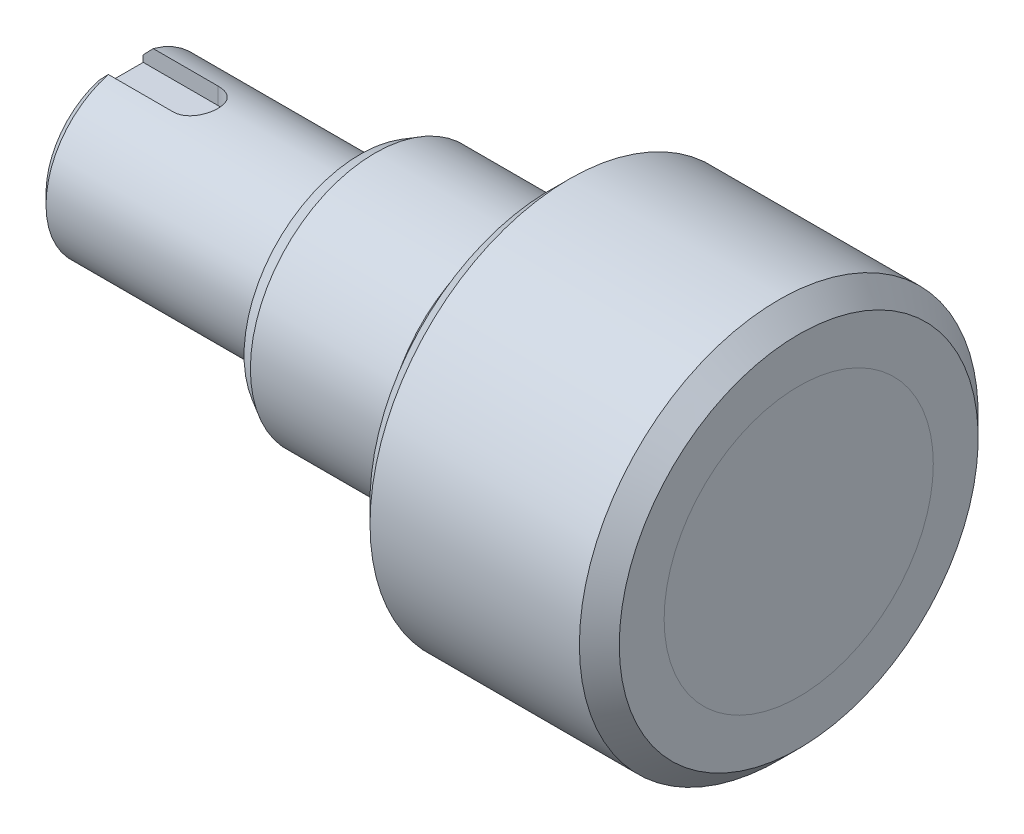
ISO-10303-21;
HEADER;
FILE_DESCRIPTION(('STEP AP214'),'2;1');
FILE_NAME('part.step','',(''),(''),'','','');
FILE_SCHEMA(('AUTOMOTIVE_DESIGN { 1 0 10303 214 1 1 1 1 }'));
ENDSEC;
DATA;
#1=APPLICATION_CONTEXT('core data for automotive mechanical design processes');
#2=APPLICATION_PROTOCOL_DEFINITION('international standard','automotive_design',2000,#1);
#3=PRODUCT_CONTEXT('',#1,'mechanical');
#4=PRODUCT('Part','Part','',(#3));
#5=PRODUCT_RELATED_PRODUCT_CATEGORY('part','',(#4));
#6=PRODUCT_DEFINITION_FORMATION('','',#4);
#7=PRODUCT_DEFINITION_CONTEXT('part definition',#1,'design');
#8=PRODUCT_DEFINITION('design','',#6,#7);
#9=PRODUCT_DEFINITION_SHAPE('','',#8);
#10=(LENGTH_UNIT() NAMED_UNIT(*) SI_UNIT(.MILLI.,.METRE.));
#11=(NAMED_UNIT(*) PLANE_ANGLE_UNIT() SI_UNIT($,.RADIAN.));
#12=(NAMED_UNIT(*) SI_UNIT($,.STERADIAN.) SOLID_ANGLE_UNIT());
#13=UNCERTAINTY_MEASURE_WITH_UNIT(LENGTH_MEASURE(1.E-05),#10,'distance_accuracy_value','');
#14=(GEOMETRIC_REPRESENTATION_CONTEXT(3) GLOBAL_UNCERTAINTY_ASSIGNED_CONTEXT((#13)) GLOBAL_UNIT_ASSIGNED_CONTEXT((#10,
#11,#12)) REPRESENTATION_CONTEXT('',''));
#15=CARTESIAN_POINT('',(0.,0.,0.));
#16=DIRECTION('',(0.,0.,1.));
#17=DIRECTION('',(1.,0.,0.));
#18=AXIS2_PLACEMENT_3D('',#15,#16,#17);
#19=CARTESIAN_POINT('',(0.,0.,0.));
#20=DIRECTION('',(1.,0.,0.));
#21=DIRECTION('',(0.,0.,-1.));
#22=AXIS2_PLACEMENT_3D('',#19,#20,#21);
#23=CYLINDRICAL_SURFACE('',#22,13.5);
#24=CARTESIAN_POINT('',(43.,0.,0.));
#25=DIRECTION('',(1.,0.,0.));
#26=DIRECTION('',(0.,0.,-1.));
#27=AXIS2_PLACEMENT_3D('',#24,#25,#26);
#28=CIRCLE('',#27,13.5);
#29=CARTESIAN_POINT('',(43.,0.,-13.5));
#30=VERTEX_POINT('',#29);
#31=EDGE_CURVE('E61',#30,#30,#28,.F.);
#32=ORIENTED_EDGE('',*,*,#31,.T.);
#33=EDGE_LOOP('',(#32));
#34=FACE_BOUND('',#33,.T.);
#35=CARTESIAN_POINT('',(68.,0.,0.));
#36=DIRECTION('',(-1.,0.,0.));
#37=DIRECTION('',(0.,0.,1.));
#38=AXIS2_PLACEMENT_3D('',#35,#36,#37);
#39=CIRCLE('',#38,13.5);
#40=CARTESIAN_POINT('',(68.,0.,13.5));
#41=VERTEX_POINT('',#40);
#42=EDGE_CURVE('E49',#41,#41,#39,.F.);
#43=ORIENTED_EDGE('',*,*,#42,.T.);
#44=EDGE_LOOP('',(#43));
#45=FACE_BOUND('',#44,.T.);
#46=ADVANCED_FACE('F45',(#34,#45),#23,.F.);
#47=CARTESIAN_POINT('',(0.,0.,0.));
#48=DIRECTION('',(-1.,0.,0.));
#49=DIRECTION('',(0.,0.,1.));
#50=AXIS2_PLACEMENT_3D('',#47,#48,#49);
#51=CYLINDRICAL_SURFACE('',#50,20.);
#52=CARTESIAN_POINT('',(45.,0.,0.));
#53=DIRECTION('',(1.,0.,0.));
#54=DIRECTION('',(0.,0.,-1.));
#55=AXIS2_PLACEMENT_3D('',#52,#53,#54);
#56=CIRCLE('',#55,20.);
#57=CARTESIAN_POINT('',(45.,0.,-20.));
#58=VERTEX_POINT('',#57);
#59=EDGE_CURVE('E58',#58,#58,#56,.T.);
#60=ORIENTED_EDGE('',*,*,#59,.T.);
#61=EDGE_LOOP('',(#60));
#62=FACE_BOUND('',#61,.T.);
#63=CARTESIAN_POINT('',(66.,0.,0.));
#64=DIRECTION('',(-1.,0.,0.));
#65=DIRECTION('',(0.,0.,1.));
#66=AXIS2_PLACEMENT_3D('',#63,#64,#65);
#67=CIRCLE('',#66,20.);
#68=CARTESIAN_POINT('',(66.,0.,20.));
#69=VERTEX_POINT('',#68);
#70=EDGE_CURVE('E53',#69,#69,#67,.T.);
#71=ORIENTED_EDGE('',*,*,#70,.T.);
#72=EDGE_LOOP('',(#71));
#73=FACE_BOUND('',#72,.T.);
#74=ADVANCED_FACE('F83',(#62,#73),#51,.T.);
#75=CARTESIAN_POINT('',(66.,0.,0.));
#76=DIRECTION('',(-1.,0.,0.));
#77=DIRECTION('',(0.,0.,1.));
#78=AXIS2_PLACEMENT_3D('',#75,#76,#77);
#79=CONICAL_SURFACE('',#78,20.,0.785398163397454);
#80=CARTESIAN_POINT('',(68.,0.,0.));
#81=DIRECTION('',(-1.,0.,0.));
#82=DIRECTION('',(0.,0.,1.));
#83=AXIS2_PLACEMENT_3D('',#80,#81,#82);
#84=CIRCLE('',#83,18.);
#85=CARTESIAN_POINT('',(68.,0.,18.));
#86=VERTEX_POINT('',#85);
#87=EDGE_CURVE('E63',#86,#86,#84,.F.);
#88=ORIENTED_EDGE('',*,*,#87,.F.);
#89=EDGE_LOOP('',(#88));
#90=FACE_BOUND('',#89,.T.);
#91=ORIENTED_EDGE('',*,*,#70,.F.);
#92=EDGE_LOOP('',(#91));
#93=FACE_BOUND('',#92,.T.);
#94=ADVANCED_FACE('F75',(#90,#93),#79,.T.);
#95=CARTESIAN_POINT('',(68.,20.,0.));
#96=DIRECTION('',(-1.,0.,0.));
#97=DIRECTION('',(0.,0.,1.));
#98=AXIS2_PLACEMENT_3D('',#95,#96,#97);
#99=PLANE('',#98);
#100=ORIENTED_EDGE('',*,*,#87,.T.);
#101=EDGE_LOOP('',(#100));
#102=FACE_BOUND('',#101,.T.);
#103=ORIENTED_EDGE('',*,*,#42,.F.);
#104=EDGE_LOOP('',(#103));
#105=FACE_BOUND('',#104,.T.);
#106=ADVANCED_FACE('F72',(#102,#105),#99,.F.);
#107=CARTESIAN_POINT('',(43.,0.,0.));
#108=DIRECTION('',(1.,0.,0.));
#109=DIRECTION('',(0.,0.,-1.));
#110=AXIS2_PLACEMENT_3D('',#107,#108,#109);
#111=CONICAL_SURFACE('',#110,18.,0.785398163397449);
#112=ORIENTED_EDGE('',*,*,#59,.F.);
#113=EDGE_LOOP('',(#112));
#114=FACE_BOUND('',#113,.T.);
#115=CARTESIAN_POINT('',(43.,0.,0.));
#116=DIRECTION('',(1.,0.,0.));
#117=DIRECTION('',(0.,0.,-1.));
#118=AXIS2_PLACEMENT_3D('',#115,#116,#117);
#119=CIRCLE('',#118,18.);
#120=CARTESIAN_POINT('',(43.,0.,-18.));
#121=VERTEX_POINT('',#120);
#122=EDGE_CURVE('E11',#121,#121,#119,.F.);
#123=ORIENTED_EDGE('',*,*,#122,.F.);
#124=EDGE_LOOP('',(#123));
#125=FACE_BOUND('',#124,.T.);
#126=ADVANCED_FACE('F74',(#114,#125),#111,.T.);
#127=CARTESIAN_POINT('',(43.,12.5,0.));
#128=DIRECTION('',(1.,0.,0.));
#129=DIRECTION('',(0.,0.,-1.));
#130=AXIS2_PLACEMENT_3D('',#127,#128,#129);
#131=PLANE('',#130);
#132=ORIENTED_EDGE('',*,*,#122,.T.);
#133=EDGE_LOOP('',(#132));
#134=FACE_BOUND('',#133,.T.);
#135=ORIENTED_EDGE('',*,*,#31,.F.);
#136=EDGE_LOOP('',(#135));
#137=FACE_BOUND('',#136,.T.);
#138=ADVANCED_FACE('F47',(#134,#137),#131,.F.);
#139=CLOSED_SHELL('',(#46,#74,#94,#106,#126,#138));
#140=MANIFOLD_SOLID_BREP('B2',#139);
#141=CARTESIAN_POINT('',(0.,0.,0.));
#142=DIRECTION('',(1.,0.,0.));
#143=DIRECTION('',(0.,0.,-1.));
#144=AXIS2_PLACEMENT_3D('',#141,#142,#143);
#145=CYLINDRICAL_SURFACE('',#144,13.5);
#146=CARTESIAN_POINT('',(68.,0.,0.));
#147=DIRECTION('',(-1.,0.,0.));
#148=DIRECTION('',(0.,0.,1.));
#149=AXIS2_PLACEMENT_3D('',#146,#147,#148);
#150=CIRCLE('',#149,13.5);
#151=CARTESIAN_POINT('',(68.,0.,13.5));
#152=VERTEX_POINT('',#151);
#153=EDGE_CURVE('E152',#152,#152,#150,.F.);
#154=ORIENTED_EDGE('',*,*,#153,.F.);
#155=EDGE_LOOP('',(#154));
#156=FACE_BOUND('',#155,.T.);
#157=CARTESIAN_POINT('',(43.,0.,0.));
#158=DIRECTION('',(1.,0.,0.));
#159=DIRECTION('',(0.,0.,-1.));
#160=AXIS2_PLACEMENT_3D('',#157,#158,#159);
#161=CIRCLE('',#160,13.5);
#162=CARTESIAN_POINT('',(43.,0.,-13.5));
#163=VERTEX_POINT('',#162);
#164=EDGE_CURVE('E43',#163,#163,#161,.F.);
#165=ORIENTED_EDGE('',*,*,#164,.F.);
#166=EDGE_LOOP('',(#165));
#167=FACE_BOUND('',#166,.T.);
#168=ADVANCED_FACE('F143',(#156,#167),#145,.T.);
#169=CARTESIAN_POINT('',(68.,20.,0.));
#170=DIRECTION('',(-1.,0.,0.));
#171=DIRECTION('',(0.,0.,1.));
#172=AXIS2_PLACEMENT_3D('',#169,#170,#171);
#173=PLANE('',#172);
#174=ORIENTED_EDGE('',*,*,#153,.T.);
#175=EDGE_LOOP('',(#174));
#176=FACE_BOUND('',#175,.T.);
#177=ADVANCED_FACE('F295',(#176),#173,.F.);
#178=CARTESIAN_POINT('',(0.,0.,0.));
#179=DIRECTION('',(-1.,0.,0.));
#180=DIRECTION('',(0.,0.,1.));
#181=AXIS2_PLACEMENT_3D('',#178,#179,#180);
#182=CYLINDRICAL_SURFACE('',#181,12.5);
#183=CARTESIAN_POINT('',(43.,0.,0.));
#184=DIRECTION('',(-1.,0.,0.));
#185=DIRECTION('',(0.,0.,1.));
#186=AXIS2_PLACEMENT_3D('',#183,#184,#185);
#187=CIRCLE('',#186,12.5);
#188=CARTESIAN_POINT('',(43.,0.,12.5));
#189=VERTEX_POINT('',#188);
#190=EDGE_CURVE('E232',#189,#189,#187,.T.);
#191=ORIENTED_EDGE('',*,*,#190,.T.);
#192=EDGE_LOOP('',(#191));
#193=FACE_BOUND('',#192,.T.);
#194=CARTESIAN_POINT('',(41.,0.,0.));
#195=DIRECTION('',(-1.,0.,0.));
#196=DIRECTION('',(0.,0.,1.));
#197=AXIS2_PLACEMENT_3D('',#194,#195,#196);
#198=CIRCLE('',#197,12.5);
#199=CARTESIAN_POINT('',(41.,0.,12.5));
#200=VERTEX_POINT('',#199);
#201=EDGE_CURVE('E223',#200,#200,#198,.T.);
#202=ORIENTED_EDGE('',*,*,#201,.F.);
#203=EDGE_LOOP('',(#202));
#204=FACE_BOUND('',#203,.T.);
#205=ADVANCED_FACE('F289',(#193,#204),#182,.T.);
#206=CARTESIAN_POINT('',(43.,12.5,0.));
#207=DIRECTION('',(1.,0.,0.));
#208=DIRECTION('',(0.,0.,-1.));
#209=AXIS2_PLACEMENT_3D('',#206,#207,#208);
#210=PLANE('',#209);
#211=ORIENTED_EDGE('',*,*,#164,.T.);
#212=EDGE_LOOP('',(#211));
#213=FACE_BOUND('',#212,.T.);
#214=ORIENTED_EDGE('',*,*,#190,.F.);
#215=EDGE_LOOP('',(#214));
#216=FACE_BOUND('',#215,.T.);
#217=ADVANCED_FACE('F290',(#213,#216),#210,.F.);
#218=CARTESIAN_POINT('',(39.,0.,0.));
#219=DIRECTION('',(-1.,0.,0.));
#220=DIRECTION('',(0.,0.,1.));
#221=AXIS2_PLACEMENT_3D('',#218,#219,#220);
#222=CONICAL_SURFACE('',#221,12.5,0.785398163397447);
#223=CARTESIAN_POINT('',(40.,0.,0.));
#224=DIRECTION('',(-1.,0.,0.));
#225=DIRECTION('',(0.,0.,1.));
#226=AXIS2_PLACEMENT_3D('',#223,#224,#225);
#227=CIRCLE('',#226,11.5);
#228=CARTESIAN_POINT('',(40.,0.,11.5));
#229=VERTEX_POINT('',#228);
#230=EDGE_CURVE('E226',#229,#229,#227,.T.);
#231=ORIENTED_EDGE('',*,*,#230,.T.);
#232=EDGE_LOOP('',(#231));
#233=FACE_BOUND('',#232,.T.);
#234=CARTESIAN_POINT('',(39.,0.,0.));
#235=DIRECTION('',(-1.,0.,0.));
#236=DIRECTION('',(0.,0.,1.));
#237=AXIS2_PLACEMENT_3D('',#234,#235,#236);
#238=CIRCLE('',#237,12.5);
#239=CARTESIAN_POINT('',(39.,0.,12.5));
#240=VERTEX_POINT('',#239);
#241=EDGE_CURVE('E229',#240,#240,#238,.T.);
#242=ORIENTED_EDGE('',*,*,#241,.F.);
#243=EDGE_LOOP('',(#242));
#244=FACE_BOUND('',#243,.T.);
#245=ADVANCED_FACE('F293',(#233,#244),#222,.T.);
#246=CARTESIAN_POINT('',(40.,0.,0.));
#247=DIRECTION('',(1.,0.,0.));
#248=DIRECTION('',(0.,0.,-1.));
#249=AXIS2_PLACEMENT_3D('',#246,#247,#248);
#250=CONICAL_SURFACE('',#249,11.5,0.785398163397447);
#251=ORIENTED_EDGE('',*,*,#201,.T.);
#252=EDGE_LOOP('',(#251));
#253=FACE_BOUND('',#252,.T.);
#254=ORIENTED_EDGE('',*,*,#230,.F.);
#255=EDGE_LOOP('',(#254));
#256=FACE_BOUND('',#255,.T.);
#257=ADVANCED_FACE('F300',(#253,#256),#250,.T.);
#258=CARTESIAN_POINT('',(0.,0.,0.));
#259=DIRECTION('',(1.,0.,0.));
#260=DIRECTION('',(0.,0.,-1.));
#261=AXIS2_PLACEMENT_3D('',#258,#259,#260);
#262=PLANE('',#261);
#263=DIRECTION('',(0.,0.,1.));
#264=VECTOR('',#263,1.);
#265=CARTESIAN_POINT('',(0.,6.5,2.25));
#266=LINE('',#265,#264);
#267=CARTESIAN_POINT('',(0.,6.5,-2.25));
#268=VERTEX_POINT('',#267);
#269=CARTESIAN_POINT('',(0.,6.5,2.25));
#270=VERTEX_POINT('',#269);
#271=EDGE_CURVE('E199',#268,#270,#266,.T.);
#272=ORIENTED_EDGE('',*,*,#271,.F.);
#273=DIRECTION('',(0.,1.,0.));
#274=VECTOR('',#273,1.);
#275=CARTESIAN_POINT('',(0.,6.5,-2.25));
#276=LINE('',#275,#274);
#277=CARTESIAN_POINT('',(0.,7.15454401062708,-2.25));
#278=VERTEX_POINT('',#277);
#279=EDGE_CURVE('E221',#268,#278,#276,.T.);
#280=ORIENTED_EDGE('',*,*,#279,.T.);
#281=CARTESIAN_POINT('',(0.,0.,0.));
#282=DIRECTION('',(1.,0.,0.));
#283=DIRECTION('',(0.,0.,-1.));
#284=AXIS2_PLACEMENT_3D('',#281,#282,#283);
#285=CIRCLE('',#284,7.49999999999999);
#286=CARTESIAN_POINT('',(0.,7.15454401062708,2.25));
#287=VERTEX_POINT('',#286);
#288=EDGE_CURVE('E211',#278,#287,#285,.F.);
#289=ORIENTED_EDGE('',*,*,#288,.T.);
#290=DIRECTION('',(0.,1.,0.));
#291=VECTOR('',#290,1.);
#292=CARTESIAN_POINT('',(0.,6.5,2.25));
#293=LINE('',#292,#291);
#294=EDGE_CURVE('E159',#270,#287,#293,.T.);
#295=ORIENTED_EDGE('',*,*,#294,.F.);
#296=EDGE_LOOP('',(#272,#280,#289,#295));
#297=FACE_BOUND('',#296,.T.);
#298=ADVANCED_FACE('F145',(#297),#262,.F.);
#299=CARTESIAN_POINT('',(0.,0.,0.));
#300=DIRECTION('',(-1.,0.,0.));
#301=DIRECTION('',(0.,0.,1.));
#302=AXIS2_PLACEMENT_3D('',#299,#300,#301);
#303=CYLINDRICAL_SURFACE('',#302,8.5);
#304=CARTESIAN_POINT('',(1.00000000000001,0.,0.));
#305=DIRECTION('',(1.,0.,0.));
#306=DIRECTION('',(0.,0.,-1.));
#307=AXIS2_PLACEMENT_3D('',#304,#305,#306);
#308=CIRCLE('',#307,8.5);
#309=CARTESIAN_POINT('',(1.00000000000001,8.1967981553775,2.25));
#310=VERTEX_POINT('',#309);
#311=CARTESIAN_POINT('',(1.00000000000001,8.1967981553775,-2.25));
#312=VERTEX_POINT('',#311);
#313=EDGE_CURVE('E239',#310,#312,#308,.T.);
#314=ORIENTED_EDGE('',*,*,#313,.T.);
#315=DIRECTION('',(-1.,0.,0.));
#316=VECTOR('',#315,1.);
#317=CARTESIAN_POINT('',(0.,8.1967981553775,-2.25));
#318=LINE('',#317,#316);
#319=CARTESIAN_POINT('',(7.5,8.1967981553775,-2.25));
#320=VERTEX_POINT('',#319);
#321=EDGE_CURVE('E167',#312,#320,#318,.F.);
#322=ORIENTED_EDGE('',*,*,#321,.T.);
#323=CARTESIAN_POINT('',(7.5,8.1967981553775,-2.25));
#324=CARTESIAN_POINT('',(7.56209437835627,8.19679073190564,-2.25000734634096));
#325=CARTESIAN_POINT('',(7.62418430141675,8.19750357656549,-2.24742964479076));
#326=CARTESIAN_POINT('',(7.74789725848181,8.20031471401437,-2.237161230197));
#327=CARTESIAN_POINT('',(7.80952037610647,8.20241275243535,-2.22947145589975));
#328=CARTESIAN_POINT('',(7.93173467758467,8.20793334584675,-2.20905768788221));
#329=CARTESIAN_POINT('',(7.99232777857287,8.21135307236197,-2.19634444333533));
#330=CARTESIAN_POINT('',(8.11217168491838,8.21940829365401,-2.16600365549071));
#331=CARTESIAN_POINT('',(8.17142246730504,8.22404380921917,-2.14837602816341));
#332=CARTESIAN_POINT('',(8.34652455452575,8.23957809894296,-2.08832126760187));
#333=CARTESIAN_POINT('',(8.45985726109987,8.25211100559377,-2.03870005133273));
#334=CARTESIAN_POINT('',(8.67657185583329,8.2801099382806,-1.92181388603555));
#335=CARTESIAN_POINT('',(8.77995051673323,8.29557691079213,-1.85454324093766));
#336=CARTESIAN_POINT('',(8.976405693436,8.32812589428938,-1.70249307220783));
#337=CARTESIAN_POINT('',(9.06920396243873,8.34523604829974,-1.61735938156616));
#338=CARTESIAN_POINT('',(9.23938699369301,8.37890142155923,-1.43275961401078));
#339=CARTESIAN_POINT('',(9.3167692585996,8.39545655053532,-1.33329121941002));
#340=CARTESIAN_POINT('',(9.45508971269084,8.4264612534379,-1.12090592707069));
#341=CARTESIAN_POINT('',(9.51574947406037,8.44087352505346,-1.00780175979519));
#342=CARTESIAN_POINT('',(9.61708356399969,8.46564323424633,-0.772560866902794));
#343=CARTESIAN_POINT('',(9.65776215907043,8.47600153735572,-0.650426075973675));
#344=CARTESIAN_POINT('',(9.71707749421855,8.49129706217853,-0.403512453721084));
#345=CARTESIAN_POINT('',(9.73619113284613,8.49635139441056,-0.278855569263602));
#346=CARTESIAN_POINT('',(9.75333399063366,8.5008788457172,-0.0280062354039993));
#347=CARTESIAN_POINT('',(9.75136622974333,8.50035276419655,0.0981859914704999));
#348=CARTESIAN_POINT('',(9.72673806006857,8.49386441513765,0.345200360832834));
#349=CARTESIAN_POINT('',(9.70459328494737,8.48803761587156,0.466078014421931));
#350=CARTESIAN_POINT('',(9.64107245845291,8.47176222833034,0.702335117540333));
#351=CARTESIAN_POINT('',(9.59969550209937,8.46131342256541,0.817714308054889));
#352=CARTESIAN_POINT('',(9.49848653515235,8.43676623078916,1.04102329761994));
#353=CARTESIAN_POINT('',(9.43847680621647,8.42263291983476,1.14886855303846));
#354=CARTESIAN_POINT('',(9.30184288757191,8.39224119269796,1.35313236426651));
#355=CARTESIAN_POINT('',(9.22521584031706,8.37598241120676,1.44954895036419));
#356=CARTESIAN_POINT('',(9.05479238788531,8.342523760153,1.6312885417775));
#357=CARTESIAN_POINT('',(8.96054784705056,8.32531029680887,1.71618924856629));
#358=CARTESIAN_POINT('',(8.75895378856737,8.29232157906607,1.86910165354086));
#359=CARTESIAN_POINT('',(8.65160066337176,8.27654672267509,1.93710868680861));
#360=CARTESIAN_POINT('',(8.42591350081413,8.24816400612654,2.05462473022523));
#361=CARTESIAN_POINT('',(8.30751237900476,8.23557748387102,2.10401013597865));
#362=CARTESIAN_POINT('',(8.06373999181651,8.21526847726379,2.18197482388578));
#363=CARTESIAN_POINT('',(7.93837949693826,8.20753869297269,2.21058534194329));
#364=CARTESIAN_POINT('',(7.75992335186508,8.2007540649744,2.23554738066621));
#365=CARTESIAN_POINT('',(7.70805593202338,8.19927314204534,2.24096766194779));
#366=CARTESIAN_POINT('',(7.60413404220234,8.19729547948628,2.24819010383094));
#367=CARTESIAN_POINT('',(7.55208000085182,8.19679717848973,2.24999800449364));
#368=CARTESIAN_POINT('',(7.5,8.1967981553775,2.25));
#369=B_SPLINE_CURVE_WITH_KNOTS('',3,(#323,#324,#325,#326,#327,#328,#329,#330,#331,#332,#333,
#334,#335,#336,#337,#338,#339,#340,#341,#342,#343,#344,#345,#346,#347,#348,#349,#350,#351,#352,
#353,#354,#355,#356,#357,#358,#359,#360,#361,#362,#363,#364,#365,#366,#367,#368),.UNSPECIFIED.,
.F.,.F.,(4,2,2,2,2,2,2,2,2,2,2,2,2,2,2,2,2,2,2,2,2,2,4),(0.,0.186217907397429,0.37240162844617,
0.558189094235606,0.743979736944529,1.11516504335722,1.48647029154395,1.86598333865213,
2.24555781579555,2.63111537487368,3.01659057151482,3.39336300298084,3.77008146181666,
4.13743473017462,4.50480528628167,4.8757934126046,5.24684538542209,5.62908857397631,
6.01143719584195,6.39628082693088,6.78054462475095,6.93694808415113,7.09310282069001),.UNSPECIFIED.);
#370=CARTESIAN_POINT('',(7.5,8.1967981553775,2.25));
#371=VERTEX_POINT('',#370);
#372=EDGE_CURVE('E268',#320,#371,#369,.T.);
#373=ORIENTED_EDGE('',*,*,#372,.T.);
#374=DIRECTION('',(-1.,0.,0.));
#375=VECTOR('',#374,1.);
#376=CARTESIAN_POINT('',(0.,8.1967981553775,2.25));
#377=LINE('',#376,#375);
#378=EDGE_CURVE('E218',#371,#310,#377,.T.);
#379=ORIENTED_EDGE('',*,*,#378,.T.);
#380=EDGE_LOOP('',(#314,#322,#373,#379));
#381=FACE_BOUND('',#380,.T.);
#382=CARTESIAN_POINT('',(24.,0.,0.));
#383=DIRECTION('',(-1.,0.,0.));
#384=DIRECTION('',(0.,0.,1.));
#385=AXIS2_PLACEMENT_3D('',#382,#383,#384);
#386=CIRCLE('',#385,8.5);
#387=CARTESIAN_POINT('',(24.,0.,8.5));
#388=VERTEX_POINT('',#387);
#389=EDGE_CURVE('E235',#388,#388,#386,.T.);
#390=ORIENTED_EDGE('',*,*,#389,.T.);
#391=EDGE_LOOP('',(#390));
#392=FACE_BOUND('',#391,.T.);
#393=ADVANCED_FACE('F276',(#381,#392),#303,.T.);
#394=CARTESIAN_POINT('',(24.,8.5,0.));
#395=DIRECTION('',(1.,0.,0.));
#396=DIRECTION('',(0.,0.,-1.));
#397=AXIS2_PLACEMENT_3D('',#394,#395,#396);
#398=PLANE('',#397);
#399=CARTESIAN_POINT('',(24.,0.,0.));
#400=DIRECTION('',(1.,0.,0.));
#401=DIRECTION('',(0.,0.,-1.));
#402=AXIS2_PLACEMENT_3D('',#399,#400,#401);
#403=CIRCLE('',#402,11.6339745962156);
#404=CARTESIAN_POINT('',(24.,0.,-11.6339745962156));
#405=VERTEX_POINT('',#404);
#406=EDGE_CURVE('E274',#405,#405,#403,.F.);
#407=ORIENTED_EDGE('',*,*,#406,.T.);
#408=EDGE_LOOP('',(#407));
#409=FACE_BOUND('',#408,.T.);
#410=ORIENTED_EDGE('',*,*,#389,.F.);
#411=EDGE_LOOP('',(#410));
#412=FACE_BOUND('',#411,.T.);
#413=ADVANCED_FACE('F280',(#409,#412),#398,.F.);
#414=CARTESIAN_POINT('',(25.5,0.,0.));
#415=DIRECTION('',(1.,0.,0.));
#416=DIRECTION('',(0.,0.,-1.));
#417=AXIS2_PLACEMENT_3D('',#414,#415,#416);
#418=CIRCLE('',#417,12.5);
#419=CARTESIAN_POINT('',(25.5,0.,-12.5));
#420=VERTEX_POINT('',#419);
#421=EDGE_CURVE('E325',#420,#420,#418,.T.);
#422=ORIENTED_EDGE('',*,*,#421,.T.);
#423=EDGE_LOOP('',(#422));
#424=FACE_BOUND('',#423,.T.);
#425=ORIENTED_EDGE('',*,*,#241,.T.);
#426=EDGE_LOOP('',(#425));
#427=FACE_BOUND('',#426,.T.);
#428=ADVANCED_FACE('F284',(#424,#427),#182,.T.);
#429=CARTESIAN_POINT('',(0.,0.,0.));
#430=DIRECTION('',(1.,0.,0.));
#431=DIRECTION('',(0.,0.,-1.));
#432=AXIS2_PLACEMENT_3D('',#429,#430,#431);
#433=CONICAL_SURFACE('',#432,7.49999999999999,0.785398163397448);
#434=CARTESIAN_POINT('',(3.25686433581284,10.5189177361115,-2.25));
#435=CARTESIAN_POINT('',(2.99811614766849,10.2543014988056,-2.25));
#436=CARTESIAN_POINT('',(2.73957180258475,9.98948532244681,-2.25));
#437=CARTESIAN_POINT('',(2.22303896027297,9.45931485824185,-2.25));
#438=CARTESIAN_POINT('',(1.96505045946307,9.19396057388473,-2.25));
#439=CARTESIAN_POINT('',(1.44980866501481,8.66260786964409,-2.25));
#440=CARTESIAN_POINT('',(1.1925552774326,8.39660954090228,-2.25));
#441=CARTESIAN_POINT('',(0.67896865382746,7.86372009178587,-2.25));
#442=CARTESIAN_POINT('',(0.422635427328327,7.59682896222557,-2.25));
#443=CARTESIAN_POINT('',(-0.0888249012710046,7.06181167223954,-2.25));
#444=CARTESIAN_POINT('',(-0.343951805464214,6.79368532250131,-2.25));
#445=CARTESIAN_POINT('',(-0.852463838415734,6.25579516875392,-2.25));
#446=CARTESIAN_POINT('',(-1.105849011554,5.98603140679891,-2.25));
#447=CARTESIAN_POINT('',(-1.48403453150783,5.57958593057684,-2.25));
#448=CARTESIAN_POINT('',(-1.60979053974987,5.44379368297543,-2.25));
#449=CARTESIAN_POINT('',(-1.8605078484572,5.17147924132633,-2.25));
#450=CARTESIAN_POINT('',(-1.98546915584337,5.03495705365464,-2.25));
#451=CARTESIAN_POINT('',(-2.23441710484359,4.76100396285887,-2.25));
#452=CARTESIAN_POINT('',(-2.35840366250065,4.62357298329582,-2.25));
#453=CARTESIAN_POINT('',(-2.60509930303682,4.34756254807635,-2.25));
#454=CARTESIAN_POINT('',(-2.72780834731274,4.20898305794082,-2.25));
#455=CARTESIAN_POINT('',(-2.84972886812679,4.06970780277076,-2.25));
#456=B_SPLINE_CURVE_WITH_KNOTS('',3,(#434,#435,#436,#437,#438,#439,#440,#441,#442,#443,#444,
#445,#446,#447,#448,#449,#450,#451,#452,#453,#454,#455),.UNSPECIFIED.,.F.,.F.,(4,2,2,2,2,2,2,2,
2,2,4),(0.,1.11029394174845,2.22058070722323,3.33071859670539,4.44086794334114,5.55119350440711,
6.66149066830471,7.21672415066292,7.77195279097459,8.3272287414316,8.88252142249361),.UNSPECIFIED.);
#457=EDGE_CURVE('E249',#312,#278,#456,.T.);
#458=ORIENTED_EDGE('',*,*,#457,.F.);
#459=ORIENTED_EDGE('',*,*,#313,.F.);
#460=CARTESIAN_POINT('',(-2.84972886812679,4.06970780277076,2.25));
#461=CARTESIAN_POINT('',(-2.72780834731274,4.20898305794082,2.25));
#462=CARTESIAN_POINT('',(-2.60509930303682,4.34756254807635,2.25));
#463=CARTESIAN_POINT('',(-2.35840366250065,4.62357298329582,2.25));
#464=CARTESIAN_POINT('',(-2.23441710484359,4.76100396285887,2.25));
#465=CARTESIAN_POINT('',(-1.98546915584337,5.03495705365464,2.25));
#466=CARTESIAN_POINT('',(-1.8605078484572,5.17147924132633,2.25));
#467=CARTESIAN_POINT('',(-1.60979053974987,5.44379368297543,2.25));
#468=CARTESIAN_POINT('',(-1.48403453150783,5.57958593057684,2.25));
#469=CARTESIAN_POINT('',(-1.105849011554,5.98603140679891,2.25));
#470=CARTESIAN_POINT('',(-0.852463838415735,6.25579516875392,2.25));
#471=CARTESIAN_POINT('',(-0.343951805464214,6.79368532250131,2.25));
#472=CARTESIAN_POINT('',(-0.0888249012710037,7.06181167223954,2.25));
#473=CARTESIAN_POINT('',(0.422635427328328,7.59682896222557,2.25));
#474=CARTESIAN_POINT('',(0.678968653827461,7.86372009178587,2.25));
#475=CARTESIAN_POINT('',(1.1925552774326,8.39660954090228,2.25));
#476=CARTESIAN_POINT('',(1.44980866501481,8.66260786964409,2.25));
#477=CARTESIAN_POINT('',(1.96505045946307,9.19396057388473,2.25));
#478=CARTESIAN_POINT('',(2.22303896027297,9.45931485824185,2.25));
#479=CARTESIAN_POINT('',(2.73957180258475,9.98948532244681,2.25));
#480=CARTESIAN_POINT('',(2.99811614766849,10.2543014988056,2.25));
#481=CARTESIAN_POINT('',(3.25686433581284,10.5189177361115,2.25));
#482=B_SPLINE_CURVE_WITH_KNOTS('',3,(#460,#461,#462,#463,#464,#465,#466,#467,#468,#469,#470,
#471,#472,#473,#474,#475,#476,#477,#478,#479,#480,#481),.UNSPECIFIED.,.F.,.F.,(4,2,2,2,2,2,2,2,
2,2,4),(0.,0.555292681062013,1.11056863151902,1.6657972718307,2.2210307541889,3.33132791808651,
4.44165347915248,5.55180282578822,6.66194071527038,7.77222748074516,8.88252142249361),.UNSPECIFIED.);
#483=EDGE_CURVE('E242',#287,#310,#482,.T.);
#484=ORIENTED_EDGE('',*,*,#483,.F.);
#485=ORIENTED_EDGE('',*,*,#288,.F.);
#486=EDGE_LOOP('',(#458,#459,#484,#485));
#487=FACE_BOUND('',#486,.T.);
#488=ADVANCED_FACE('F255',(#487),#433,.T.);
#489=CARTESIAN_POINT('',(7.5,6.5,0.));
#490=DIRECTION('',(0.,1.,0.));
#491=DIRECTION('',(0.,0.,1.));
#492=AXIS2_PLACEMENT_3D('',#489,#490,#491);
#493=CYLINDRICAL_SURFACE('',#492,2.25);
#494=DIRECTION('',(0.,1.,0.));
#495=VECTOR('',#494,1.);
#496=CARTESIAN_POINT('',(7.5,6.5,-2.25));
#497=LINE('',#496,#495);
#498=CARTESIAN_POINT('',(7.5,6.5,-2.25));
#499=VERTEX_POINT('',#498);
#500=EDGE_CURVE('E213',#499,#320,#497,.T.);
#501=ORIENTED_EDGE('',*,*,#500,.F.);
#502=CARTESIAN_POINT('',(7.5,6.5,0.));
#503=DIRECTION('',(0.,1.,0.));
#504=DIRECTION('',(0.,0.,1.));
#505=AXIS2_PLACEMENT_3D('',#502,#503,#504);
#506=CIRCLE('',#505,2.25);
#507=CARTESIAN_POINT('',(7.5,6.5,2.25));
#508=VERTEX_POINT('',#507);
#509=EDGE_CURVE('E198',#508,#499,#506,.T.);
#510=ORIENTED_EDGE('',*,*,#509,.F.);
#511=DIRECTION('',(0.,1.,0.));
#512=VECTOR('',#511,1.);
#513=CARTESIAN_POINT('',(7.5,6.5,2.25));
#514=LINE('',#513,#512);
#515=EDGE_CURVE('E194',#508,#371,#514,.T.);
#516=ORIENTED_EDGE('',*,*,#515,.T.);
#517=ORIENTED_EDGE('',*,*,#372,.F.);
#518=EDGE_LOOP('',(#501,#510,#516,#517));
#519=FACE_BOUND('',#518,.T.);
#520=ADVANCED_FACE('F262',(#519),#493,.F.);
#521=CARTESIAN_POINT('',(0.,6.5,-2.25));
#522=DIRECTION('',(0.,0.,-1.));
#523=DIRECTION('',(-1.,0.,0.));
#524=AXIS2_PLACEMENT_3D('',#521,#522,#523);
#525=PLANE('',#524);
#526=ORIENTED_EDGE('',*,*,#457,.T.);
#527=ORIENTED_EDGE('',*,*,#279,.F.);
#528=DIRECTION('',(-1.,0.,0.));
#529=VECTOR('',#528,1.);
#530=CARTESIAN_POINT('',(0.,6.5,-2.25));
#531=LINE('',#530,#529);
#532=EDGE_CURVE('E205',#499,#268,#531,.T.);
#533=ORIENTED_EDGE('',*,*,#532,.F.);
#534=ORIENTED_EDGE('',*,*,#500,.T.);
#535=ORIENTED_EDGE('',*,*,#321,.F.);
#536=EDGE_LOOP('',(#526,#527,#533,#534,#535));
#537=FACE_BOUND('',#536,.T.);
#538=ADVANCED_FACE('F261',(#537),#525,.F.);
#539=CARTESIAN_POINT('',(0.,6.5,2.25));
#540=DIRECTION('',(0.,0.,1.));
#541=DIRECTION('',(1.,0.,0.));
#542=AXIS2_PLACEMENT_3D('',#539,#540,#541);
#543=PLANE('',#542);
#544=ORIENTED_EDGE('',*,*,#515,.F.);
#545=DIRECTION('',(1.,0.,0.));
#546=VECTOR('',#545,1.);
#547=CARTESIAN_POINT('',(0.,6.5,2.25));
#548=LINE('',#547,#546);
#549=EDGE_CURVE('E190',#270,#508,#548,.T.);
#550=ORIENTED_EDGE('',*,*,#549,.F.);
#551=ORIENTED_EDGE('',*,*,#294,.T.);
#552=ORIENTED_EDGE('',*,*,#483,.T.);
#553=ORIENTED_EDGE('',*,*,#378,.F.);
#554=EDGE_LOOP('',(#544,#550,#551,#552,#553));
#555=FACE_BOUND('',#554,.T.);
#556=ADVANCED_FACE('F192',(#555),#543,.F.);
#557=CARTESIAN_POINT('',(7.5,6.5,0.));
#558=DIRECTION('',(0.,1.,0.));
#559=DIRECTION('',(0.,0.,1.));
#560=AXIS2_PLACEMENT_3D('',#557,#558,#559);
#561=PLANE('',#560);
#562=ORIENTED_EDGE('',*,*,#271,.T.);
#563=ORIENTED_EDGE('',*,*,#549,.T.);
#564=ORIENTED_EDGE('',*,*,#509,.T.);
#565=ORIENTED_EDGE('',*,*,#532,.T.);
#566=EDGE_LOOP('',(#562,#563,#564,#565));
#567=FACE_BOUND('',#566,.T.);
#568=ADVANCED_FACE('F203',(#567),#561,.T.);
#569=CARTESIAN_POINT('',(24.,0.,0.));
#570=DIRECTION('',(1.,0.,0.));
#571=DIRECTION('',(0.,0.,-1.));
#572=AXIS2_PLACEMENT_3D('',#569,#570,#571);
#573=CONICAL_SURFACE('',#572,11.6339745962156,0.523598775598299);
#574=ORIENTED_EDGE('',*,*,#421,.F.);
#575=EDGE_LOOP('',(#574));
#576=FACE_BOUND('',#575,.T.);
#577=ORIENTED_EDGE('',*,*,#406,.F.);
#578=EDGE_LOOP('',(#577));
#579=FACE_BOUND('',#578,.T.);
#580=ADVANCED_FACE('F311',(#576,#579),#573,.T.);
#581=CLOSED_SHELL('',(#168,#177,#205,#217,#245,#257,#298,#393,#413,#428,#488,#520,#538,#556,
#568,#580));
#582=MANIFOLD_SOLID_BREP('B6',#581);
#583=ADVANCED_BREP_SHAPE_REPRESENTATION('',(#18,#140,#582),#14);
#584=SHAPE_DEFINITION_REPRESENTATION(#9,#583);
ENDSEC;
END-ISO-10303-21;
